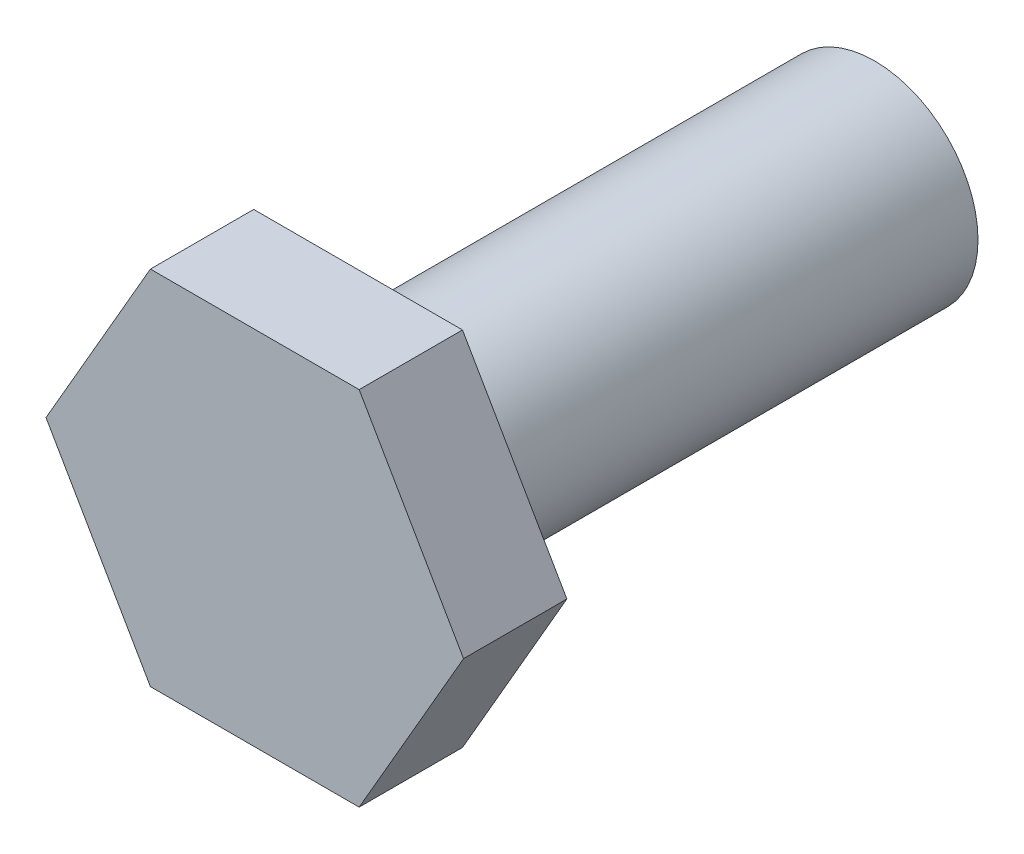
from build123d import *

# Parameters (mm, degrees)
EXTRUDE1_DEPTH = 2.54
SKETCH3_R      = 2.54
EXTRUDE2_DEPTH = 12.7


with BuildPart() as part:
    # Sketch2 → Extrude1 (new body)
    with BuildSketch(Plane.XY):
        Polygon((27.966321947, 23.495), (22.833678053, 23.495), (20.267356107, 19.05), (22.833678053, 14.605), (27.966321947, 14.605), (30.532643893, 19.05), align=None)
    extrude(amount=EXTRUDE1_DEPTH)

    # Sketch3 → Extrude2 (add)
    with BuildSketch(Plane(origin=(0, 0, 0), x_dir=(-1, 0, 0), z_dir=(0, 0, -1))):
        with Locations((-25.4, 19.05)):
            Circle(SKETCH3_R)
    extrude(amount=EXTRUDE2_DEPTH)


solid = part.part
